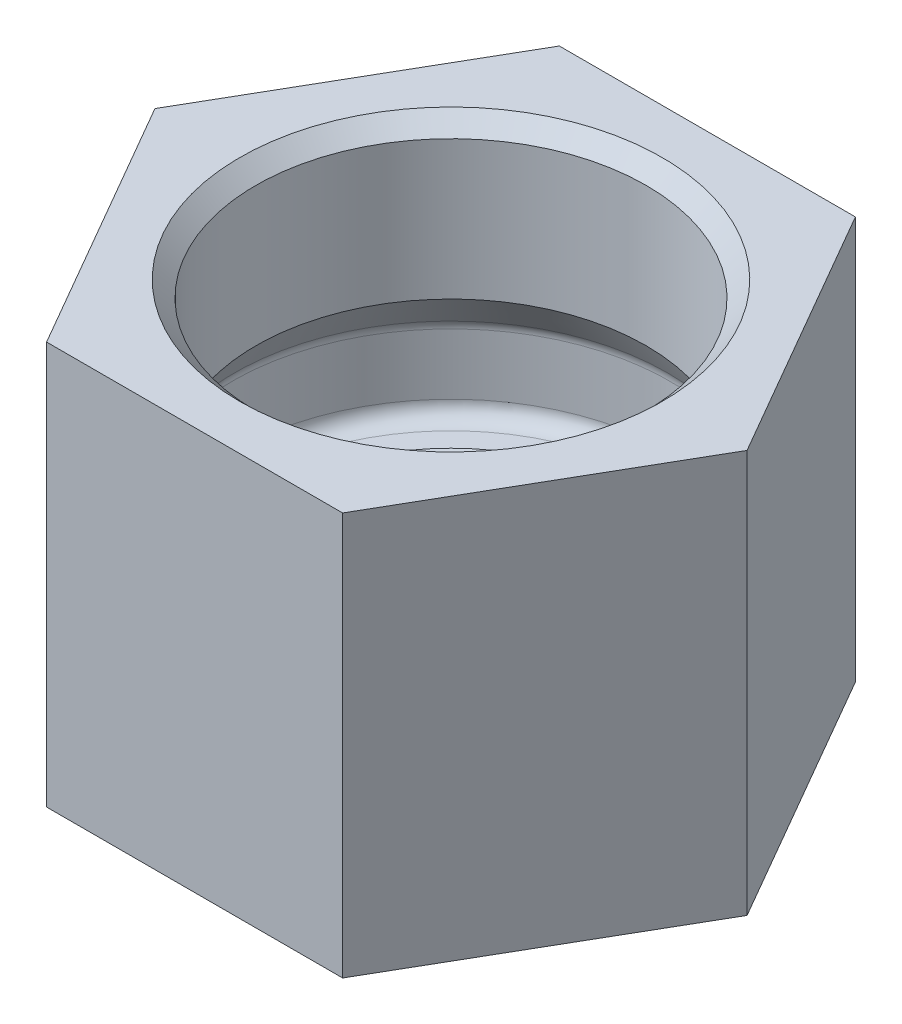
from build123d import *

# Parameters (mm, degrees)
P_IDAT_VYSUNUT_M3_DEPTH = 18.85


with BuildPart() as part:
    # Skica4 → P_idat vysunut_m3 (new body)
    with BuildSketch(Plane(origin=(0, 0, 0), x_dir=(1, 0, 0), z_dir=(0, 1, 0))):
        Polygon((13.856406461, 0), (6.92820323, 12), (-6.92820323, 12), (-13.856406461, 0), (-6.92820323, -12), (6.92820323, -12), align=None)
    extrude(amount=P_IDAT_VYSUNUT_M3_DEPTH)

    # Skica1 → Odebrat rotac_1 (revolve, cut)
    with BuildSketch(Plane(origin=(0, 0, 0), x_dir=(0, 0, -1), z_dir=(1, 0, 0))):
        with BuildLine():
            Line((-7, 0), (0, 0))
            Line((0, 0), (0, 18.897499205))
            Line((0, 18.897499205), (-9.935998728, 18.897499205))
            Line((-9.935998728, 18.897499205), (-9.135998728, 18.097499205))
            Line((-9.135998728, 18.097499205), (-9.135998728, 11.597499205))
            Line((-9.135998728, 11.597499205), (-10.135998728, 9.997499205))
            ThreePointArc((-10.135998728, 9.997499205), (-10.22093656, 9.806761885), (-10.25, 9.6))
            Line((-10.25, 9.6), (-10.25, 6.75))
            ThreePointArc((-10.25, 6.75), (-10.030330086, 6.219669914), (-9.5, 6))
            Line((-9.5, 6), (-8.5, 6))
            Line((-8.5, 6), (-7, 4.5))
            Line((-7, 4.5), (-7, 0))
        make_face()
    revolve(axis=Axis((0, 50.195240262, 0), (0, -1, 0)), mode=Mode.SUBTRACT)


solid = part.part
